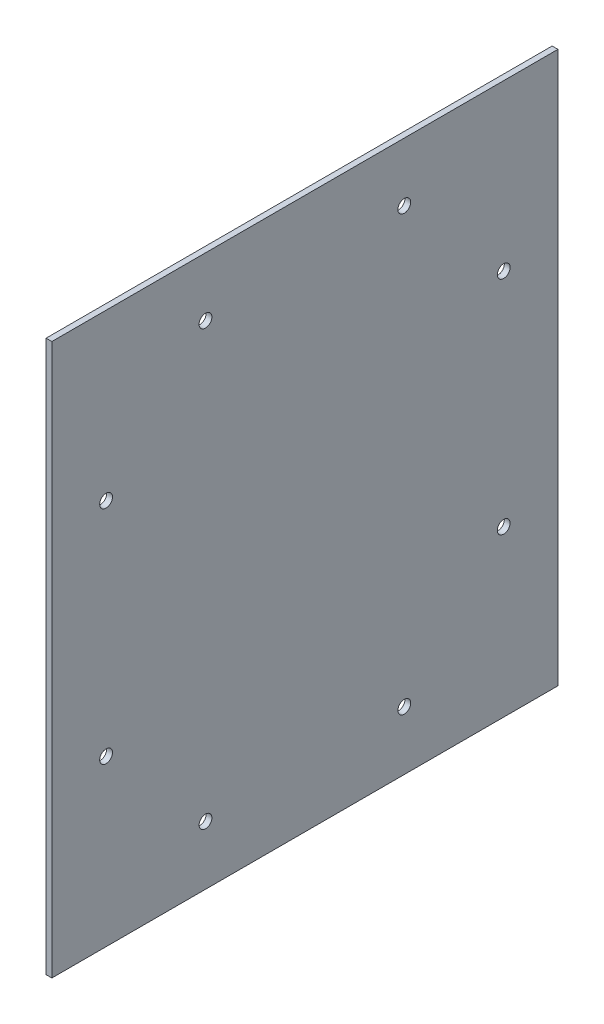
ISO-10303-21;
HEADER;
FILE_DESCRIPTION(('STEP AP214'),'2;1');
FILE_NAME('part.step','',(''),(''),'','','');
FILE_SCHEMA(('AUTOMOTIVE_DESIGN { 1 0 10303 214 1 1 1 1 }'));
ENDSEC;
DATA;
#1=APPLICATION_CONTEXT('core data for automotive mechanical design processes');
#2=APPLICATION_PROTOCOL_DEFINITION('international standard','automotive_design',2000,#1);
#3=PRODUCT_CONTEXT('',#1,'mechanical');
#4=PRODUCT('Part','Part','',(#3));
#5=PRODUCT_RELATED_PRODUCT_CATEGORY('part','',(#4));
#6=PRODUCT_DEFINITION_FORMATION('','',#4);
#7=PRODUCT_DEFINITION_CONTEXT('part definition',#1,'design');
#8=PRODUCT_DEFINITION('design','',#6,#7);
#9=PRODUCT_DEFINITION_SHAPE('','',#8);
#10=(LENGTH_UNIT() NAMED_UNIT(*) SI_UNIT(.MILLI.,.METRE.));
#11=(NAMED_UNIT(*) PLANE_ANGLE_UNIT() SI_UNIT($,.RADIAN.));
#12=(NAMED_UNIT(*) SI_UNIT($,.STERADIAN.) SOLID_ANGLE_UNIT());
#13=UNCERTAINTY_MEASURE_WITH_UNIT(LENGTH_MEASURE(1.E-05),#10,'distance_accuracy_value','');
#14=(GEOMETRIC_REPRESENTATION_CONTEXT(3) GLOBAL_UNCERTAINTY_ASSIGNED_CONTEXT((#13)) GLOBAL_UNIT_ASSIGNED_CONTEXT((#10,
#11,#12)) REPRESENTATION_CONTEXT('',''));
#15=CARTESIAN_POINT('',(0.,0.,0.));
#16=DIRECTION('',(0.,0.,1.));
#17=DIRECTION('',(1.,0.,0.));
#18=AXIS2_PLACEMENT_3D('',#15,#16,#17);
#19=CARTESIAN_POINT('',(4.064,-193.675,0.));
#20=DIRECTION('',(0.,1.,0.));
#21=DIRECTION('',(0.,0.,1.));
#22=AXIS2_PLACEMENT_3D('',#19,#20,#21);
#23=PLANE('',#22);
#24=DIRECTION('',(0.,0.,-1.));
#25=VECTOR('',#24,1.);
#26=CARTESIAN_POINT('',(0.,-193.675,0.));
#27=LINE('',#26,#25);
#28=CARTESIAN_POINT('',(0.,-193.675,177.8));
#29=VERTEX_POINT('',#28);
#30=CARTESIAN_POINT('',(0.,-193.675,-177.8));
#31=VERTEX_POINT('',#30);
#32=EDGE_CURVE('E108',#29,#31,#27,.T.);
#33=ORIENTED_EDGE('',*,*,#32,.T.);
#34=DIRECTION('',(-1.,0.,0.));
#35=VECTOR('',#34,1.);
#36=CARTESIAN_POINT('',(4.064,-193.675,-177.8));
#37=LINE('',#36,#35);
#38=CARTESIAN_POINT('',(4.064,-193.675,-177.8));
#39=VERTEX_POINT('',#38);
#40=EDGE_CURVE('E11',#39,#31,#37,.T.);
#41=ORIENTED_EDGE('',*,*,#40,.F.);
#42=DIRECTION('',(0.,0.,-1.));
#43=VECTOR('',#42,1.);
#44=CARTESIAN_POINT('',(4.064,-193.675,0.));
#45=LINE('',#44,#43);
#46=CARTESIAN_POINT('',(4.064,-193.675,177.8));
#47=VERTEX_POINT('',#46);
#48=EDGE_CURVE('E94',#47,#39,#45,.T.);
#49=ORIENTED_EDGE('',*,*,#48,.F.);
#50=DIRECTION('',(-1.,0.,0.));
#51=VECTOR('',#50,1.);
#52=CARTESIAN_POINT('',(4.064,-193.675,177.8));
#53=LINE('',#52,#51);
#54=EDGE_CURVE('E61',#47,#29,#53,.T.);
#55=ORIENTED_EDGE('',*,*,#54,.T.);
#56=EDGE_LOOP('',(#33,#41,#49,#55));
#57=FACE_BOUND('',#56,.T.);
#58=ADVANCED_FACE('F45',(#57),#23,.F.);
#59=CARTESIAN_POINT('',(4.064,0.,-177.8));
#60=DIRECTION('',(0.,0.,1.));
#61=DIRECTION('',(1.,0.,0.));
#62=AXIS2_PLACEMENT_3D('',#59,#60,#61);
#63=PLANE('',#62);
#64=DIRECTION('',(0.,1.,0.));
#65=VECTOR('',#64,1.);
#66=CARTESIAN_POINT('',(0.,0.,-177.8));
#67=LINE('',#66,#65);
#68=CARTESIAN_POINT('',(0.,193.675,-177.8));
#69=VERTEX_POINT('',#68);
#70=EDGE_CURVE('E99',#31,#69,#67,.T.);
#71=ORIENTED_EDGE('',*,*,#70,.T.);
#72=DIRECTION('',(-1.,0.,0.));
#73=VECTOR('',#72,1.);
#74=CARTESIAN_POINT('',(4.064,193.675,-177.8));
#75=LINE('',#74,#73);
#76=CARTESIAN_POINT('',(4.064,193.675,-177.8));
#77=VERTEX_POINT('',#76);
#78=EDGE_CURVE('E53',#77,#69,#75,.T.);
#79=ORIENTED_EDGE('',*,*,#78,.F.);
#80=DIRECTION('',(0.,1.,0.));
#81=VECTOR('',#80,1.);
#82=CARTESIAN_POINT('',(4.064,0.,-177.8));
#83=LINE('',#82,#81);
#84=EDGE_CURVE('E86',#39,#77,#83,.T.);
#85=ORIENTED_EDGE('',*,*,#84,.F.);
#86=ORIENTED_EDGE('',*,*,#40,.T.);
#87=EDGE_LOOP('',(#71,#79,#85,#86));
#88=FACE_BOUND('',#87,.T.);
#89=ADVANCED_FACE('F98',(#88),#63,.F.);
#90=CARTESIAN_POINT('',(4.064,193.675,0.));
#91=DIRECTION('',(0.,1.,0.));
#92=DIRECTION('',(0.,0.,1.));
#93=AXIS2_PLACEMENT_3D('',#90,#91,#92);
#94=PLANE('',#93);
#95=DIRECTION('',(0.,0.,-1.));
#96=VECTOR('',#95,1.);
#97=CARTESIAN_POINT('',(0.,193.675,0.));
#98=LINE('',#97,#96);
#99=CARTESIAN_POINT('',(0.,193.675,177.8));
#100=VERTEX_POINT('',#99);
#101=EDGE_CURVE('E112',#100,#69,#98,.T.);
#102=ORIENTED_EDGE('',*,*,#101,.F.);
#103=DIRECTION('',(-1.,0.,0.));
#104=VECTOR('',#103,1.);
#105=CARTESIAN_POINT('',(4.064,193.675,177.8));
#106=LINE('',#105,#104);
#107=CARTESIAN_POINT('',(4.064,193.675,177.8));
#108=VERTEX_POINT('',#107);
#109=EDGE_CURVE('E75',#108,#100,#106,.T.);
#110=ORIENTED_EDGE('',*,*,#109,.F.);
#111=DIRECTION('',(0.,0.,-1.));
#112=VECTOR('',#111,1.);
#113=CARTESIAN_POINT('',(4.064,193.675,0.));
#114=LINE('',#113,#112);
#115=EDGE_CURVE('E93',#108,#77,#114,.T.);
#116=ORIENTED_EDGE('',*,*,#115,.T.);
#117=ORIENTED_EDGE('',*,*,#78,.T.);
#118=EDGE_LOOP('',(#102,#110,#116,#117));
#119=FACE_BOUND('',#118,.T.);
#120=ADVANCED_FACE('F102',(#119),#94,.T.);
#121=CARTESIAN_POINT('',(4.064,0.,177.8));
#122=DIRECTION('',(0.,0.,1.));
#123=DIRECTION('',(1.,0.,0.));
#124=AXIS2_PLACEMENT_3D('',#121,#122,#123);
#125=PLANE('',#124);
#126=DIRECTION('',(0.,1.,0.));
#127=VECTOR('',#126,1.);
#128=CARTESIAN_POINT('',(0.,0.,177.8));
#129=LINE('',#128,#127);
#130=EDGE_CURVE('E114',#29,#100,#129,.T.);
#131=ORIENTED_EDGE('',*,*,#130,.F.);
#132=ORIENTED_EDGE('',*,*,#54,.F.);
#133=DIRECTION('',(0.,1.,0.));
#134=VECTOR('',#133,1.);
#135=CARTESIAN_POINT('',(4.064,0.,177.8));
#136=LINE('',#135,#134);
#137=EDGE_CURVE('E103',#47,#108,#136,.T.);
#138=ORIENTED_EDGE('',*,*,#137,.T.);
#139=ORIENTED_EDGE('',*,*,#109,.T.);
#140=EDGE_LOOP('',(#131,#132,#138,#139));
#141=FACE_BOUND('',#140,.T.);
#142=ADVANCED_FACE('F173',(#141),#125,.T.);
#143=CARTESIAN_POINT('',(4.064,0.,0.));
#144=DIRECTION('',(1.,0.,0.));
#145=DIRECTION('',(0.,0.,-1.));
#146=AXIS2_PLACEMENT_3D('',#143,#144,#145);
#147=PLANE('',#146);
#148=CARTESIAN_POINT('',(4.064,77.7875,139.7));
#149=DIRECTION('',(1.,0.,0.));
#150=DIRECTION('',(0.,0.,-1.));
#151=AXIS2_PLACEMENT_3D('',#148,#149,#150);
#152=CIRCLE('',#151,4.5);
#153=CARTESIAN_POINT('',(4.064,77.7875,135.2));
#154=VERTEX_POINT('',#153);
#155=EDGE_CURVE('E164',#154,#154,#152,.T.);
#156=ORIENTED_EDGE('',*,*,#155,.F.);
#157=EDGE_LOOP('',(#156));
#158=FACE_BOUND('',#157,.T.);
#159=CARTESIAN_POINT('',(4.064,152.4,69.85));
#160=DIRECTION('',(1.,0.,0.));
#161=DIRECTION('',(0.,0.,-1.));
#162=AXIS2_PLACEMENT_3D('',#159,#160,#161);
#163=CIRCLE('',#162,4.5);
#164=CARTESIAN_POINT('',(4.064,152.4,65.35));
#165=VERTEX_POINT('',#164);
#166=EDGE_CURVE('E158',#165,#165,#163,.T.);
#167=ORIENTED_EDGE('',*,*,#166,.F.);
#168=EDGE_LOOP('',(#167));
#169=FACE_BOUND('',#168,.T.);
#170=CARTESIAN_POINT('',(4.064,152.4,-69.85));
#171=DIRECTION('',(1.,0.,0.));
#172=DIRECTION('',(0.,0.,-1.));
#173=AXIS2_PLACEMENT_3D('',#170,#171,#172);
#174=CIRCLE('',#173,4.5);
#175=CARTESIAN_POINT('',(4.064,152.4,-74.35));
#176=VERTEX_POINT('',#175);
#177=EDGE_CURVE('E152',#176,#176,#174,.T.);
#178=ORIENTED_EDGE('',*,*,#177,.F.);
#179=EDGE_LOOP('',(#178));
#180=FACE_BOUND('',#179,.T.);
#181=CARTESIAN_POINT('',(4.064,77.7875,-139.7));
#182=DIRECTION('',(1.,0.,0.));
#183=DIRECTION('',(0.,0.,-1.));
#184=AXIS2_PLACEMENT_3D('',#181,#182,#183);
#185=CIRCLE('',#184,4.5);
#186=CARTESIAN_POINT('',(4.064,77.7875,-144.2));
#187=VERTEX_POINT('',#186);
#188=EDGE_CURVE('E146',#187,#187,#185,.T.);
#189=ORIENTED_EDGE('',*,*,#188,.F.);
#190=EDGE_LOOP('',(#189));
#191=FACE_BOUND('',#190,.T.);
#192=CARTESIAN_POINT('',(4.064,-77.7875,-139.7));
#193=DIRECTION('',(1.,0.,0.));
#194=DIRECTION('',(0.,0.,-1.));
#195=AXIS2_PLACEMENT_3D('',#192,#193,#194);
#196=CIRCLE('',#195,4.5);
#197=CARTESIAN_POINT('',(4.064,-77.7875,-144.2));
#198=VERTEX_POINT('',#197);
#199=EDGE_CURVE('E140',#198,#198,#196,.T.);
#200=ORIENTED_EDGE('',*,*,#199,.F.);
#201=EDGE_LOOP('',(#200));
#202=FACE_BOUND('',#201,.T.);
#203=CARTESIAN_POINT('',(4.064,-152.4,-69.85));
#204=DIRECTION('',(1.,0.,0.));
#205=DIRECTION('',(0.,0.,-1.));
#206=AXIS2_PLACEMENT_3D('',#203,#204,#205);
#207=CIRCLE('',#206,4.5);
#208=CARTESIAN_POINT('',(4.064,-152.4,-74.35));
#209=VERTEX_POINT('',#208);
#210=EDGE_CURVE('E134',#209,#209,#207,.T.);
#211=ORIENTED_EDGE('',*,*,#210,.F.);
#212=EDGE_LOOP('',(#211));
#213=FACE_BOUND('',#212,.T.);
#214=CARTESIAN_POINT('',(4.064,-152.4,69.85));
#215=DIRECTION('',(1.,0.,0.));
#216=DIRECTION('',(0.,0.,-1.));
#217=AXIS2_PLACEMENT_3D('',#214,#215,#216);
#218=CIRCLE('',#217,4.5);
#219=CARTESIAN_POINT('',(4.064,-152.4,65.35));
#220=VERTEX_POINT('',#219);
#221=EDGE_CURVE('E128',#220,#220,#218,.T.);
#222=ORIENTED_EDGE('',*,*,#221,.F.);
#223=EDGE_LOOP('',(#222));
#224=FACE_BOUND('',#223,.T.);
#225=CARTESIAN_POINT('',(4.064,-77.7875,139.7));
#226=DIRECTION('',(1.,0.,0.));
#227=DIRECTION('',(0.,0.,-1.));
#228=AXIS2_PLACEMENT_3D('',#225,#226,#227);
#229=CIRCLE('',#228,4.5);
#230=CARTESIAN_POINT('',(4.064,-77.7875,135.2));
#231=VERTEX_POINT('',#230);
#232=EDGE_CURVE('E122',#231,#231,#229,.T.);
#233=ORIENTED_EDGE('',*,*,#232,.F.);
#234=EDGE_LOOP('',(#233));
#235=FACE_BOUND('',#234,.T.);
#236=ORIENTED_EDGE('',*,*,#48,.T.);
#237=ORIENTED_EDGE('',*,*,#84,.T.);
#238=ORIENTED_EDGE('',*,*,#115,.F.);
#239=ORIENTED_EDGE('',*,*,#137,.F.);
#240=EDGE_LOOP('',(#236,#237,#238,#239));
#241=FACE_BOUND('',#240,.T.);
#242=ADVANCED_FACE('F90',(#158,#169,#180,#191,#202,#213,#224,#235,#241),#147,.T.);
#243=CARTESIAN_POINT('',(0.,0.,0.));
#244=DIRECTION('',(1.,0.,0.));
#245=DIRECTION('',(0.,0.,-1.));
#246=AXIS2_PLACEMENT_3D('',#243,#244,#245);
#247=PLANE('',#246);
#248=CARTESIAN_POINT('',(0.,77.7875,139.7));
#249=DIRECTION('',(1.,0.,0.));
#250=DIRECTION('',(0.,0.,-1.));
#251=AXIS2_PLACEMENT_3D('',#248,#249,#250);
#252=CIRCLE('',#251,4.5);
#253=CARTESIAN_POINT('',(0.,77.7875,135.2));
#254=VERTEX_POINT('',#253);
#255=EDGE_CURVE('E161',#254,#254,#252,.T.);
#256=ORIENTED_EDGE('',*,*,#255,.T.);
#257=EDGE_LOOP('',(#256));
#258=FACE_BOUND('',#257,.T.);
#259=CARTESIAN_POINT('',(0.,152.4,69.85));
#260=DIRECTION('',(1.,0.,0.));
#261=DIRECTION('',(0.,0.,-1.));
#262=AXIS2_PLACEMENT_3D('',#259,#260,#261);
#263=CIRCLE('',#262,4.5);
#264=CARTESIAN_POINT('',(0.,152.4,65.35));
#265=VERTEX_POINT('',#264);
#266=EDGE_CURVE('E155',#265,#265,#263,.T.);
#267=ORIENTED_EDGE('',*,*,#266,.T.);
#268=EDGE_LOOP('',(#267));
#269=FACE_BOUND('',#268,.T.);
#270=CARTESIAN_POINT('',(0.,152.4,-69.85));
#271=DIRECTION('',(1.,0.,0.));
#272=DIRECTION('',(0.,0.,-1.));
#273=AXIS2_PLACEMENT_3D('',#270,#271,#272);
#274=CIRCLE('',#273,4.5);
#275=CARTESIAN_POINT('',(0.,152.4,-74.35));
#276=VERTEX_POINT('',#275);
#277=EDGE_CURVE('E149',#276,#276,#274,.T.);
#278=ORIENTED_EDGE('',*,*,#277,.T.);
#279=EDGE_LOOP('',(#278));
#280=FACE_BOUND('',#279,.T.);
#281=CARTESIAN_POINT('',(0.,77.7875,-139.7));
#282=DIRECTION('',(1.,0.,0.));
#283=DIRECTION('',(0.,0.,-1.));
#284=AXIS2_PLACEMENT_3D('',#281,#282,#283);
#285=CIRCLE('',#284,4.5);
#286=CARTESIAN_POINT('',(0.,77.7875,-144.2));
#287=VERTEX_POINT('',#286);
#288=EDGE_CURVE('E143',#287,#287,#285,.T.);
#289=ORIENTED_EDGE('',*,*,#288,.T.);
#290=EDGE_LOOP('',(#289));
#291=FACE_BOUND('',#290,.T.);
#292=CARTESIAN_POINT('',(0.,-77.7875,-139.7));
#293=DIRECTION('',(1.,0.,0.));
#294=DIRECTION('',(0.,0.,-1.));
#295=AXIS2_PLACEMENT_3D('',#292,#293,#294);
#296=CIRCLE('',#295,4.5);
#297=CARTESIAN_POINT('',(0.,-77.7875,-144.2));
#298=VERTEX_POINT('',#297);
#299=EDGE_CURVE('E137',#298,#298,#296,.T.);
#300=ORIENTED_EDGE('',*,*,#299,.T.);
#301=EDGE_LOOP('',(#300));
#302=FACE_BOUND('',#301,.T.);
#303=CARTESIAN_POINT('',(0.,-152.4,-69.85));
#304=DIRECTION('',(1.,0.,0.));
#305=DIRECTION('',(0.,0.,-1.));
#306=AXIS2_PLACEMENT_3D('',#303,#304,#305);
#307=CIRCLE('',#306,4.5);
#308=CARTESIAN_POINT('',(0.,-152.4,-74.35));
#309=VERTEX_POINT('',#308);
#310=EDGE_CURVE('E131',#309,#309,#307,.T.);
#311=ORIENTED_EDGE('',*,*,#310,.T.);
#312=EDGE_LOOP('',(#311));
#313=FACE_BOUND('',#312,.T.);
#314=CARTESIAN_POINT('',(0.,-152.4,69.85));
#315=DIRECTION('',(1.,0.,0.));
#316=DIRECTION('',(0.,0.,-1.));
#317=AXIS2_PLACEMENT_3D('',#314,#315,#316);
#318=CIRCLE('',#317,4.5);
#319=CARTESIAN_POINT('',(0.,-152.4,65.35));
#320=VERTEX_POINT('',#319);
#321=EDGE_CURVE('E125',#320,#320,#318,.T.);
#322=ORIENTED_EDGE('',*,*,#321,.T.);
#323=EDGE_LOOP('',(#322));
#324=FACE_BOUND('',#323,.T.);
#325=CARTESIAN_POINT('',(0.,-77.7875,139.7));
#326=DIRECTION('',(1.,0.,0.));
#327=DIRECTION('',(0.,0.,-1.));
#328=AXIS2_PLACEMENT_3D('',#325,#326,#327);
#329=CIRCLE('',#328,4.5);
#330=CARTESIAN_POINT('',(0.,-77.7875,135.2));
#331=VERTEX_POINT('',#330);
#332=EDGE_CURVE('E110',#331,#331,#329,.T.);
#333=ORIENTED_EDGE('',*,*,#332,.T.);
#334=EDGE_LOOP('',(#333));
#335=FACE_BOUND('',#334,.T.);
#336=ORIENTED_EDGE('',*,*,#32,.F.);
#337=ORIENTED_EDGE('',*,*,#130,.T.);
#338=ORIENTED_EDGE('',*,*,#101,.T.);
#339=ORIENTED_EDGE('',*,*,#70,.F.);
#340=EDGE_LOOP('',(#336,#337,#338,#339));
#341=FACE_BOUND('',#340,.T.);
#342=ADVANCED_FACE('F172',(#258,#269,#280,#291,#302,#313,#324,#335,#341),#247,.F.);
#343=CARTESIAN_POINT('',(4.064,-77.7875,139.7));
#344=DIRECTION('',(1.,0.,0.));
#345=DIRECTION('',(0.,0.,-1.));
#346=AXIS2_PLACEMENT_3D('',#343,#344,#345);
#347=CYLINDRICAL_SURFACE('',#346,4.5);
#348=ORIENTED_EDGE('',*,*,#332,.F.);
#349=EDGE_LOOP('',(#348));
#350=FACE_BOUND('',#349,.T.);
#351=ORIENTED_EDGE('',*,*,#232,.T.);
#352=EDGE_LOOP('',(#351));
#353=FACE_BOUND('',#352,.T.);
#354=ADVANCED_FACE('F189',(#350,#353),#347,.F.);
#355=CARTESIAN_POINT('',(4.064,-152.4,69.85));
#356=DIRECTION('',(1.,0.,0.));
#357=DIRECTION('',(0.,0.,-1.));
#358=AXIS2_PLACEMENT_3D('',#355,#356,#357);
#359=CYLINDRICAL_SURFACE('',#358,4.5);
#360=ORIENTED_EDGE('',*,*,#321,.F.);
#361=EDGE_LOOP('',(#360));
#362=FACE_BOUND('',#361,.T.);
#363=ORIENTED_EDGE('',*,*,#221,.T.);
#364=EDGE_LOOP('',(#363));
#365=FACE_BOUND('',#364,.T.);
#366=ADVANCED_FACE('F191',(#362,#365),#359,.F.);
#367=CARTESIAN_POINT('',(4.064,-152.4,-69.85));
#368=DIRECTION('',(1.,0.,0.));
#369=DIRECTION('',(0.,0.,-1.));
#370=AXIS2_PLACEMENT_3D('',#367,#368,#369);
#371=CYLINDRICAL_SURFACE('',#370,4.5);
#372=ORIENTED_EDGE('',*,*,#310,.F.);
#373=EDGE_LOOP('',(#372));
#374=FACE_BOUND('',#373,.T.);
#375=ORIENTED_EDGE('',*,*,#210,.T.);
#376=EDGE_LOOP('',(#375));
#377=FACE_BOUND('',#376,.T.);
#378=ADVANCED_FACE('F198',(#374,#377),#371,.F.);
#379=CARTESIAN_POINT('',(4.064,-77.7875,-139.7));
#380=DIRECTION('',(1.,0.,0.));
#381=DIRECTION('',(0.,0.,-1.));
#382=AXIS2_PLACEMENT_3D('',#379,#380,#381);
#383=CYLINDRICAL_SURFACE('',#382,4.5);
#384=ORIENTED_EDGE('',*,*,#299,.F.);
#385=EDGE_LOOP('',(#384));
#386=FACE_BOUND('',#385,.T.);
#387=ORIENTED_EDGE('',*,*,#199,.T.);
#388=EDGE_LOOP('',(#387));
#389=FACE_BOUND('',#388,.T.);
#390=ADVANCED_FACE('F258',(#386,#389),#383,.F.);
#391=CARTESIAN_POINT('',(4.064,77.7875,-139.7));
#392=DIRECTION('',(1.,0.,0.));
#393=DIRECTION('',(0.,0.,-1.));
#394=AXIS2_PLACEMENT_3D('',#391,#392,#393);
#395=CYLINDRICAL_SURFACE('',#394,4.5);
#396=ORIENTED_EDGE('',*,*,#288,.F.);
#397=EDGE_LOOP('',(#396));
#398=FACE_BOUND('',#397,.T.);
#399=ORIENTED_EDGE('',*,*,#188,.T.);
#400=EDGE_LOOP('',(#399));
#401=FACE_BOUND('',#400,.T.);
#402=ADVANCED_FACE('F267',(#398,#401),#395,.F.);
#403=CARTESIAN_POINT('',(4.064,152.4,-69.85));
#404=DIRECTION('',(1.,0.,0.));
#405=DIRECTION('',(0.,0.,-1.));
#406=AXIS2_PLACEMENT_3D('',#403,#404,#405);
#407=CYLINDRICAL_SURFACE('',#406,4.5);
#408=ORIENTED_EDGE('',*,*,#277,.F.);
#409=EDGE_LOOP('',(#408));
#410=FACE_BOUND('',#409,.T.);
#411=ORIENTED_EDGE('',*,*,#177,.T.);
#412=EDGE_LOOP('',(#411));
#413=FACE_BOUND('',#412,.T.);
#414=ADVANCED_FACE('F276',(#410,#413),#407,.F.);
#415=CARTESIAN_POINT('',(4.064,152.4,69.85));
#416=DIRECTION('',(1.,0.,0.));
#417=DIRECTION('',(0.,0.,-1.));
#418=AXIS2_PLACEMENT_3D('',#415,#416,#417);
#419=CYLINDRICAL_SURFACE('',#418,4.5);
#420=ORIENTED_EDGE('',*,*,#266,.F.);
#421=EDGE_LOOP('',(#420));
#422=FACE_BOUND('',#421,.T.);
#423=ORIENTED_EDGE('',*,*,#166,.T.);
#424=EDGE_LOOP('',(#423));
#425=FACE_BOUND('',#424,.T.);
#426=ADVANCED_FACE('F285',(#422,#425),#419,.F.);
#427=CARTESIAN_POINT('',(4.064,77.7875,139.7));
#428=DIRECTION('',(1.,0.,0.));
#429=DIRECTION('',(0.,0.,-1.));
#430=AXIS2_PLACEMENT_3D('',#427,#428,#429);
#431=CYLINDRICAL_SURFACE('',#430,4.5);
#432=ORIENTED_EDGE('',*,*,#255,.F.);
#433=EDGE_LOOP('',(#432));
#434=FACE_BOUND('',#433,.T.);
#435=ORIENTED_EDGE('',*,*,#155,.T.);
#436=EDGE_LOOP('',(#435));
#437=FACE_BOUND('',#436,.T.);
#438=ADVANCED_FACE('F168',(#434,#437),#431,.F.);
#439=CLOSED_SHELL('',(#58,#89,#120,#142,#242,#342,#354,#366,#378,#390,#402,#414,#426,#438));
#440=MANIFOLD_SOLID_BREP('B2',#439);
#441=ADVANCED_BREP_SHAPE_REPRESENTATION('',(#18,#440),#14);
#442=SHAPE_DEFINITION_REPRESENTATION(#9,#441);
ENDSEC;
END-ISO-10303-21;
